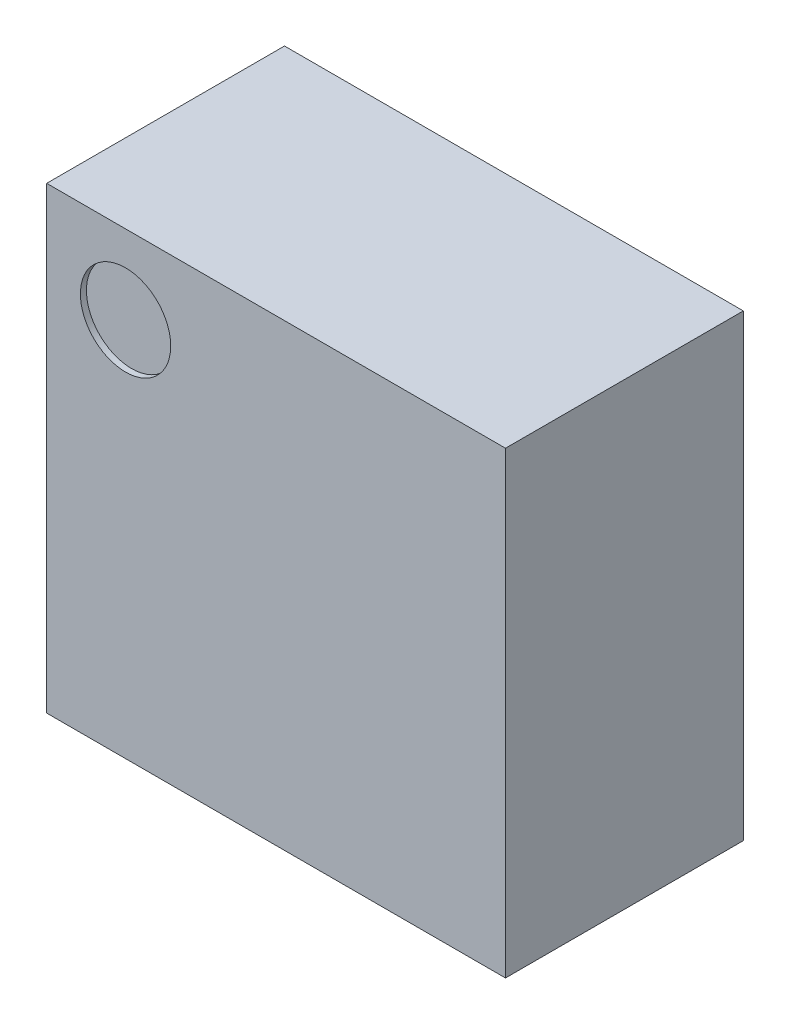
ISO-10303-21;
HEADER;
FILE_DESCRIPTION(('STEP AP214'),'2;1');
FILE_NAME('part.step','',(''),(''),'','','');
FILE_SCHEMA(('AUTOMOTIVE_DESIGN { 1 0 10303 214 1 1 1 1 }'));
ENDSEC;
DATA;
#1=APPLICATION_CONTEXT('core data for automotive mechanical design processes');
#2=APPLICATION_PROTOCOL_DEFINITION('international standard','automotive_design',2000,#1);
#3=PRODUCT_CONTEXT('',#1,'mechanical');
#4=PRODUCT('Part','Part','',(#3));
#5=PRODUCT_RELATED_PRODUCT_CATEGORY('part','',(#4));
#6=PRODUCT_DEFINITION_FORMATION('','',#4);
#7=PRODUCT_DEFINITION_CONTEXT('part definition',#1,'design');
#8=PRODUCT_DEFINITION('design','',#6,#7);
#9=PRODUCT_DEFINITION_SHAPE('','',#8);
#10=(LENGTH_UNIT() NAMED_UNIT(*) SI_UNIT(.MILLI.,.METRE.));
#11=(NAMED_UNIT(*) PLANE_ANGLE_UNIT() SI_UNIT($,.RADIAN.));
#12=(NAMED_UNIT(*) SI_UNIT($,.STERADIAN.) SOLID_ANGLE_UNIT());
#13=UNCERTAINTY_MEASURE_WITH_UNIT(LENGTH_MEASURE(1.E-05),#10,'distance_accuracy_value','');
#14=(GEOMETRIC_REPRESENTATION_CONTEXT(3) GLOBAL_UNCERTAINTY_ASSIGNED_CONTEXT((#13)) GLOBAL_UNIT_ASSIGNED_CONTEXT((#10,
#11,#12)) REPRESENTATION_CONTEXT('',''));
#15=CARTESIAN_POINT('',(0.,0.,0.));
#16=DIRECTION('',(0.,0.,1.));
#17=DIRECTION('',(1.,0.,0.));
#18=AXIS2_PLACEMENT_3D('',#15,#16,#17);
#19=CARTESIAN_POINT('',(0.,0.,0.53875000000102));
#20=DIRECTION('',(0.,0.,1.));
#21=DIRECTION('',(1.,0.,0.));
#22=AXIS2_PLACEMENT_3D('',#19,#20,#21);
#23=PLANE('',#22);
#24=CARTESIAN_POINT('',(-0.249999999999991,0.249999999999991,0.53875000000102));
#25=DIRECTION('',(0.,0.,1.));
#26=DIRECTION('',(1.,0.,0.));
#27=AXIS2_PLACEMENT_3D('',#24,#25,#26);
#28=CIRCLE('',#27,0.0750000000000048);
#29=CARTESIAN_POINT('',(-0.174999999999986,0.249999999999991,0.53875000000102));
#30=VERTEX_POINT('',#29);
#31=EDGE_CURVE('E19',#30,#30,#28,.T.);
#32=ORIENTED_EDGE('',*,*,#31,.T.);
#33=EDGE_LOOP('',(#32));
#34=FACE_BOUND('',#33,.T.);
#35=ADVANCED_FACE('F16',(#34),#23,.T.);
#36=CARTESIAN_POINT('',(-0.249999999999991,0.249999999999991,0.54875000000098));
#37=DIRECTION('',(0.,0.,1.));
#38=DIRECTION('',(1.,0.,0.));
#39=AXIS2_PLACEMENT_3D('',#36,#37,#38);
#40=CYLINDRICAL_SURFACE('',#39,0.0750000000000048);
#41=ORIENTED_EDGE('',*,*,#31,.F.);
#42=EDGE_LOOP('',(#41));
#43=FACE_BOUND('',#42,.T.);
#44=CARTESIAN_POINT('',(-0.249999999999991,0.249999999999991,0.54875000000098));
#45=DIRECTION('',(0.,0.,1.));
#46=DIRECTION('',(1.,0.,0.));
#47=AXIS2_PLACEMENT_3D('',#44,#45,#46);
#48=CIRCLE('',#47,0.0750000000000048);
#49=CARTESIAN_POINT('',(-0.174999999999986,0.249999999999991,0.54875000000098));
#50=VERTEX_POINT('',#49);
#51=EDGE_CURVE('E74',#50,#50,#48,.F.);
#52=ORIENTED_EDGE('',*,*,#51,.F.);
#53=EDGE_LOOP('',(#52));
#54=FACE_BOUND('',#53,.T.);
#55=ADVANCED_FACE('F89',(#43,#54),#40,.F.);
#56=CARTESIAN_POINT('',(0.,0.,0.54875000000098));
#57=DIRECTION('',(0.,0.,1.));
#58=DIRECTION('',(1.,0.,0.));
#59=AXIS2_PLACEMENT_3D('',#56,#57,#58);
#60=PLANE('',#59);
#61=ORIENTED_EDGE('',*,*,#51,.T.);
#62=EDGE_LOOP('',(#61));
#63=FACE_BOUND('',#62,.T.);
#64=DIRECTION('',(1.,0.,0.));
#65=VECTOR('',#64,1.);
#66=CARTESIAN_POINT('',(0.381,0.381,0.54875000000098));
#67=LINE('',#66,#65);
#68=CARTESIAN_POINT('',(-0.381,0.381,0.54875000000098));
#69=VERTEX_POINT('',#68);
#70=CARTESIAN_POINT('',(0.381,0.381,0.54875000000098));
#71=VERTEX_POINT('',#70);
#72=EDGE_CURVE('E70',#69,#71,#67,.T.);
#73=ORIENTED_EDGE('',*,*,#72,.F.);
#74=DIRECTION('',(0.,1.,0.));
#75=VECTOR('',#74,1.);
#76=CARTESIAN_POINT('',(-0.381,0.381,0.54875000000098));
#77=LINE('',#76,#75);
#78=CARTESIAN_POINT('',(-0.381,-0.381,0.54875000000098));
#79=VERTEX_POINT('',#78);
#80=EDGE_CURVE('E66',#79,#69,#77,.T.);
#81=ORIENTED_EDGE('',*,*,#80,.F.);
#82=DIRECTION('',(1.,0.,0.));
#83=VECTOR('',#82,1.);
#84=CARTESIAN_POINT('',(-0.381,-0.381,0.54875000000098));
#85=LINE('',#84,#83);
#86=CARTESIAN_POINT('',(0.381,-0.381,0.54875000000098));
#87=VERTEX_POINT('',#86);
#88=EDGE_CURVE('E57',#87,#79,#85,.F.);
#89=ORIENTED_EDGE('',*,*,#88,.F.);
#90=DIRECTION('',(0.,1.,0.));
#91=VECTOR('',#90,1.);
#92=CARTESIAN_POINT('',(0.381,-0.381,0.54875000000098));
#93=LINE('',#92,#91);
#94=EDGE_CURVE('E52',#71,#87,#93,.F.);
#95=ORIENTED_EDGE('',*,*,#94,.F.);
#96=EDGE_LOOP('',(#73,#81,#89,#95));
#97=FACE_BOUND('',#96,.T.);
#98=ADVANCED_FACE('F69',(#63,#97),#60,.T.);
#99=CARTESIAN_POINT('',(-0.381,0.381,0.));
#100=DIRECTION('',(-1.,0.,0.));
#101=DIRECTION('',(0.,0.,1.));
#102=AXIS2_PLACEMENT_3D('',#99,#100,#101);
#103=PLANE('',#102);
#104=DIRECTION('',(0.,0.,1.));
#105=VECTOR('',#104,1.);
#106=CARTESIAN_POINT('',(-0.381,0.381,0.));
#107=LINE('',#106,#105);
#108=CARTESIAN_POINT('',(-0.381,0.381,0.15375000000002));
#109=VERTEX_POINT('',#108);
#110=EDGE_CURVE('E199',#109,#69,#107,.T.);
#111=ORIENTED_EDGE('',*,*,#110,.F.);
#112=DIRECTION('',(0.,1.,0.));
#113=VECTOR('',#112,1.);
#114=CARTESIAN_POINT('',(-0.381,0.,0.15375000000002));
#115=LINE('',#114,#113);
#116=CARTESIAN_POINT('',(-0.381,-0.381,0.15375000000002));
#117=VERTEX_POINT('',#116);
#118=EDGE_CURVE('E78',#109,#117,#115,.F.);
#119=ORIENTED_EDGE('',*,*,#118,.T.);
#120=DIRECTION('',(0.,0.,-1.));
#121=VECTOR('',#120,1.);
#122=CARTESIAN_POINT('',(-0.381,-0.381,0.));
#123=LINE('',#122,#121);
#124=EDGE_CURVE('E62',#79,#117,#123,.T.);
#125=ORIENTED_EDGE('',*,*,#124,.F.);
#126=ORIENTED_EDGE('',*,*,#80,.T.);
#127=EDGE_LOOP('',(#111,#119,#125,#126));
#128=FACE_BOUND('',#127,.T.);
#129=ADVANCED_FACE('F77',(#128),#103,.T.);
#130=CARTESIAN_POINT('',(-0.381,-0.381,0.));
#131=DIRECTION('',(0.,-1.,0.));
#132=DIRECTION('',(0.,0.,-1.));
#133=AXIS2_PLACEMENT_3D('',#130,#131,#132);
#134=PLANE('',#133);
#135=ORIENTED_EDGE('',*,*,#124,.T.);
#136=DIRECTION('',(1.,0.,0.));
#137=VECTOR('',#136,1.);
#138=CARTESIAN_POINT('',(0.,-0.381,0.15375000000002));
#139=LINE('',#138,#137);
#140=CARTESIAN_POINT('',(0.381,-0.381,0.15375000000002));
#141=VERTEX_POINT('',#140);
#142=EDGE_CURVE('E200',#117,#141,#139,.T.);
#143=ORIENTED_EDGE('',*,*,#142,.T.);
#144=DIRECTION('',(0.,0.,-1.));
#145=VECTOR('',#144,1.);
#146=CARTESIAN_POINT('',(0.381,-0.381,0.));
#147=LINE('',#146,#145);
#148=EDGE_CURVE('E64',#87,#141,#147,.T.);
#149=ORIENTED_EDGE('',*,*,#148,.F.);
#150=ORIENTED_EDGE('',*,*,#88,.T.);
#151=EDGE_LOOP('',(#135,#143,#149,#150));
#152=FACE_BOUND('',#151,.T.);
#153=ADVANCED_FACE('F59',(#152),#134,.T.);
#154=CARTESIAN_POINT('',(0.381,-0.381,0.));
#155=DIRECTION('',(1.,0.,0.));
#156=DIRECTION('',(0.,0.,-1.));
#157=AXIS2_PLACEMENT_3D('',#154,#155,#156);
#158=PLANE('',#157);
#159=ORIENTED_EDGE('',*,*,#148,.T.);
#160=DIRECTION('',(0.,1.,0.));
#161=VECTOR('',#160,1.);
#162=CARTESIAN_POINT('',(0.381,0.,0.15375000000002));
#163=LINE('',#162,#161);
#164=CARTESIAN_POINT('',(0.381,0.381,0.15375000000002));
#165=VERTEX_POINT('',#164);
#166=EDGE_CURVE('E25',#141,#165,#163,.T.);
#167=ORIENTED_EDGE('',*,*,#166,.T.);
#168=DIRECTION('',(0.,0.,1.));
#169=VECTOR('',#168,1.);
#170=CARTESIAN_POINT('',(0.381,0.381,0.));
#171=LINE('',#170,#169);
#172=EDGE_CURVE('E33',#71,#165,#171,.F.);
#173=ORIENTED_EDGE('',*,*,#172,.F.);
#174=ORIENTED_EDGE('',*,*,#94,.T.);
#175=EDGE_LOOP('',(#159,#167,#173,#174));
#176=FACE_BOUND('',#175,.T.);
#177=ADVANCED_FACE('F106',(#176),#158,.T.);
#178=CARTESIAN_POINT('',(0.381,0.381,0.));
#179=DIRECTION('',(0.,1.,0.));
#180=DIRECTION('',(0.,0.,1.));
#181=AXIS2_PLACEMENT_3D('',#178,#179,#180);
#182=PLANE('',#181);
#183=ORIENTED_EDGE('',*,*,#172,.T.);
#184=DIRECTION('',(1.,0.,0.));
#185=VECTOR('',#184,1.);
#186=CARTESIAN_POINT('',(0.,0.381,0.15375000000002));
#187=LINE('',#186,#185);
#188=EDGE_CURVE('E11',#165,#109,#187,.F.);
#189=ORIENTED_EDGE('',*,*,#188,.T.);
#190=ORIENTED_EDGE('',*,*,#110,.T.);
#191=ORIENTED_EDGE('',*,*,#72,.T.);
#192=EDGE_LOOP('',(#183,#189,#190,#191));
#193=FACE_BOUND('',#192,.T.);
#194=ADVANCED_FACE('F100',(#193),#182,.T.);
#195=CARTESIAN_POINT('',(0.,0.,0.15375000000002));
#196=DIRECTION('',(0.,0.,1.));
#197=DIRECTION('',(1.,0.,0.));
#198=AXIS2_PLACEMENT_3D('',#195,#196,#197);
#199=PLANE('',#198);
#200=ORIENTED_EDGE('',*,*,#166,.F.);
#201=ORIENTED_EDGE('',*,*,#142,.F.);
#202=ORIENTED_EDGE('',*,*,#118,.F.);
#203=ORIENTED_EDGE('',*,*,#188,.F.);
#204=EDGE_LOOP('',(#200,#201,#202,#203));
#205=FACE_BOUND('',#204,.T.);
#206=ADVANCED_FACE('F98',(#205),#199,.F.);
#207=CLOSED_SHELL('',(#35,#55,#98,#129,#153,#177,#194,#206));
#208=MANIFOLD_SOLID_BREP('B1',#207);
#209=ADVANCED_BREP_SHAPE_REPRESENTATION('',(#18,#208),#14);
#210=SHAPE_DEFINITION_REPRESENTATION(#9,#209);
ENDSEC;
END-ISO-10303-21;
